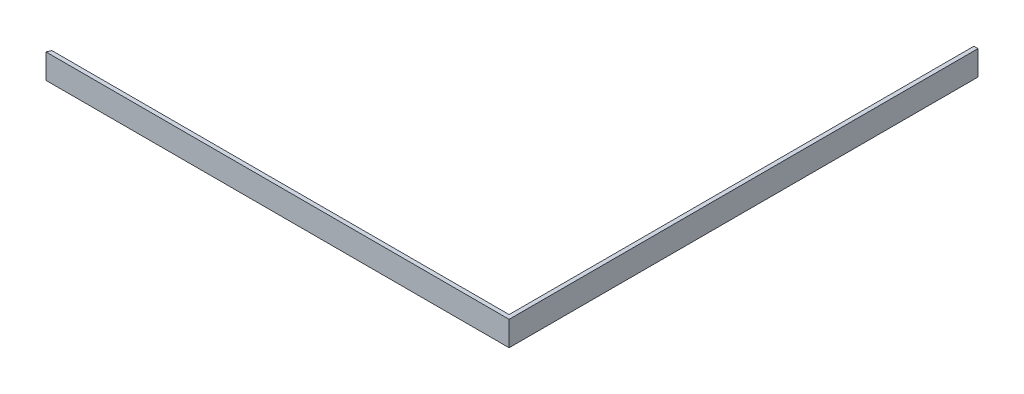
from build123d import *

# Parameters (mm, degrees)
SKETCH1_W           = 6.35
SKETCH1_H           = 38.1
BOSS_EXTRUDE1_DEPTH = 717.55
SKETCH2_W           = 6.35
SKETCH2_H           = 38.1
BOSS_EXTRUDE2_DEPTH = 711.2
SKETCH3_W           = 6.35
SKETCH3_H           = 38.1
BOSS_EXTRUDE3_DEPTH = 6.35
CUT_EXTRUDE2_DEPTH  = 1016.523638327


with BuildPart() as part:
    # Sketch1 → Boss-Extrude1 (new body)
    with BuildSketch(Plane.XY):
        with Locations((3.175, 19.05)):
            Rectangle(SKETCH1_W, SKETCH1_H)
    extrude(amount=BOSS_EXTRUDE1_DEPTH)



with BuildPart() as body_2:
    # Sketch2 → Boss-Extrude2 (new body)
    with BuildSketch(Plane.ZY):
        with Locations((720.725, 19.05)):
            Rectangle(SKETCH2_W, SKETCH2_H)
    extrude(amount=BOSS_EXTRUDE2_DEPTH)


with BuildPart() as part_1:
    add(part.part)

    add(body_2.part)  # Boss-Extrude3 merges body 2
    # Sketch3 → Boss-Extrude3 (add)
    with BuildSketch(Plane(origin=(0, 0, 0), x_dir=(0, 0, -1), z_dir=(1, 0, 0))):
        with Locations((-720.725, 19.05)):
            Rectangle(SKETCH3_W, SKETCH3_H)
    extrude(amount=BOSS_EXTRUDE3_DEPTH)

    # Sketch5 → Cut-Extrude2 (cut, through all)
    with BuildSketch(Plane.XZ):
        Polygon((-711.2, 723.9), (-711.2, 717.55), (-705.939487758, 717.55), (-708.634902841, 723.9), align=None)
    extrude(amount=-CUT_EXTRUDE2_DEPTH, mode=Mode.SUBTRACT)


solid = part_1.part
